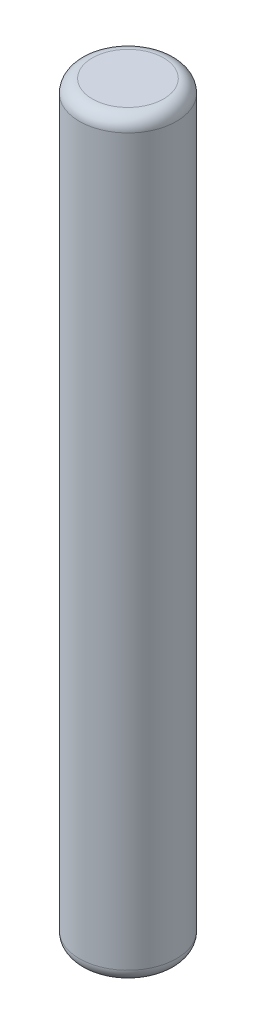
from build123d import *

# Parameters (mm, degrees)
SKETCH_1_R      = 0.375
EXTRUDE_1_DEPTH = 5.8
FILLET_1_R      = 0.1


with BuildPart() as part:
    # Sketch 1 → Extrude 1 (new body)
    with BuildSketch(Plane(origin=(0, 0, 0), x_dir=(1, 0, 0), z_dir=(0, 1, 0))):
        with Locations(Location((0, 0, 0), (0, 0, 270))):
            Circle(SKETCH_1_R)
    extrude(amount=EXTRUDE_1_DEPTH)

    # Fillet 1
    fillet_1_edges = [part.edges().sort_by_distance(p)[0] for p in [
        (0, 0, -0.375),
        (0, 5.8, -0.375),
    ]]
    fillet(fillet_1_edges, radius=FILLET_1_R)


solid = part.part
